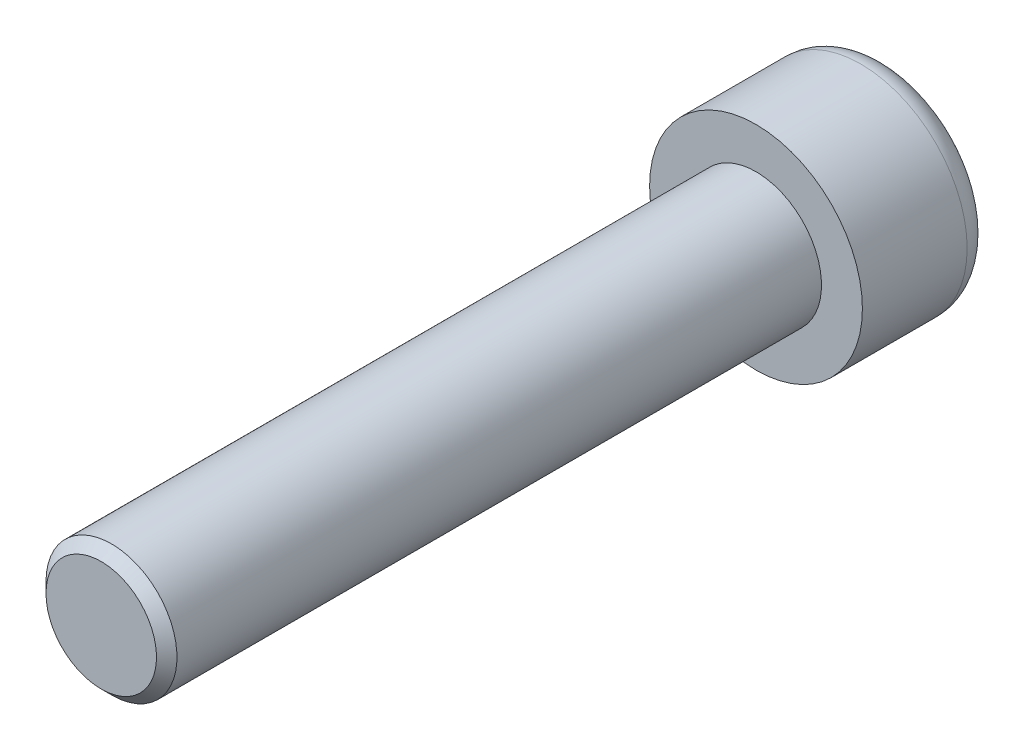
ISO-10303-21;
HEADER;
FILE_DESCRIPTION(('STEP AP214'),'2;1');
FILE_NAME('part.step','',(''),(''),'','','');
FILE_SCHEMA(('AUTOMOTIVE_DESIGN { 1 0 10303 214 1 1 1 1 }'));
ENDSEC;
DATA;
#1=APPLICATION_CONTEXT('core data for automotive mechanical design processes');
#2=APPLICATION_PROTOCOL_DEFINITION('international standard','automotive_design',2000,#1);
#3=PRODUCT_CONTEXT('',#1,'mechanical');
#4=PRODUCT('Part','Part','',(#3));
#5=PRODUCT_RELATED_PRODUCT_CATEGORY('part','',(#4));
#6=PRODUCT_DEFINITION_FORMATION('','',#4);
#7=PRODUCT_DEFINITION_CONTEXT('part definition',#1,'design');
#8=PRODUCT_DEFINITION('design','',#6,#7);
#9=PRODUCT_DEFINITION_SHAPE('','',#8);
#10=(LENGTH_UNIT() NAMED_UNIT(*) SI_UNIT(.MILLI.,.METRE.));
#11=(NAMED_UNIT(*) PLANE_ANGLE_UNIT() SI_UNIT($,.RADIAN.));
#12=(NAMED_UNIT(*) SI_UNIT($,.STERADIAN.) SOLID_ANGLE_UNIT());
#13=UNCERTAINTY_MEASURE_WITH_UNIT(LENGTH_MEASURE(1.E-05),#10,'distance_accuracy_value','');
#14=(GEOMETRIC_REPRESENTATION_CONTEXT(3) GLOBAL_UNCERTAINTY_ASSIGNED_CONTEXT((#13)) GLOBAL_UNIT_ASSIGNED_CONTEXT((#10,
#11,#12)) REPRESENTATION_CONTEXT('',''));
#15=CARTESIAN_POINT('',(0.,0.,0.));
#16=DIRECTION('',(0.,0.,1.));
#17=DIRECTION('',(1.,0.,0.));
#18=AXIS2_PLACEMENT_3D('',#15,#16,#17);
#19=CARTESIAN_POINT('',(-4.71844785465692E-13,5.27355936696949E-13,8.00000000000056));
#20=DIRECTION('',(0.,0.,0.99999999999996));
#21=DIRECTION('',(1.00000000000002,0.,0.));
#22=AXIS2_PLACEMENT_3D('',#19,#20,#21);
#23=PLANE('',#22);
#24=CARTESIAN_POINT('',(-4.71844785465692E-13,5.27355936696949E-13,8.00000000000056));
#25=DIRECTION('',(0.,0.,0.99999999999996));
#26=DIRECTION('',(1.00000000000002,0.,0.));
#27=AXIS2_PLACEMENT_3D('',#24,#25,#26);
#28=CIRCLE('',#27,6.5);
#29=CARTESIAN_POINT('',(-6.50000000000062,5.77149439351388E-13,8.00000000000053));
#30=VERTEX_POINT('',#29);
#31=EDGE_CURVE('E137',#30,#30,#28,.T.);
#32=ORIENTED_EDGE('',*,*,#31,.T.);
#33=EDGE_LOOP('',(#32));
#34=FACE_BOUND('',#33,.T.);
#35=CARTESIAN_POINT('',(-4.71844785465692E-13,5.27355936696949E-13,8.00000000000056));
#36=DIRECTION('',(0.,0.,0.99999999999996));
#37=DIRECTION('',(1.00000000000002,0.,0.));
#38=AXIS2_PLACEMENT_3D('',#35,#36,#37);
#39=CIRCLE('',#38,4.);
#40=CARTESIAN_POINT('',(-4.00000000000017,8.74168360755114E-13,8.00000000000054));
#41=VERTEX_POINT('',#40);
#42=EDGE_CURVE('E124',#41,#41,#39,.T.);
#43=ORIENTED_EDGE('',*,*,#42,.F.);
#44=EDGE_LOOP('',(#43));
#45=FACE_BOUND('',#44,.T.);
#46=ADVANCED_FACE('F34',(#34,#45),#23,.T.);
#47=CARTESIAN_POINT('',(-4.71844785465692E-13,5.27355936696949E-13,8.00000000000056));
#48=DIRECTION('',(0.,0.,-0.99999999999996));
#49=DIRECTION('',(-1.00000000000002,0.,0.));
#50=AXIS2_PLACEMENT_3D('',#47,#48,#49);
#51=CYLINDRICAL_SURFACE('',#50,6.5);
#52=CARTESIAN_POINT('',(3.33066907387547E-13,6.93889390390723E-13,1.59999999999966));
#53=DIRECTION('',(0.,0.,0.99999999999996));
#54=DIRECTION('',(1.00000000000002,0.,0.));
#55=AXIS2_PLACEMENT_3D('',#52,#53,#54);
#56=CIRCLE('',#55,6.5);
#57=CARTESIAN_POINT('',(-6.50000000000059,5.87768653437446E-13,1.59999999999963));
#58=VERTEX_POINT('',#57);
#59=EDGE_CURVE('E42',#58,#58,#56,.T.);
#60=CARTESIAN_POINT('',(-6.50000000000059,5.87768653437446E-13,1.59999999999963));
#61=CARTESIAN_POINT('',(-6.50000000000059,5.87658036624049E-13,1.66666666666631));
#62=CARTESIAN_POINT('',(-6.50000000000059,5.87547419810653E-13,1.73333333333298));
#63=CARTESIAN_POINT('',(-6.50000000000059,5.8732618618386E-13,1.86666666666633));
#64=CARTESIAN_POINT('',(-6.50000000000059,5.87215569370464E-13,1.93333333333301));
#65=CARTESIAN_POINT('',(-6.50000000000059,5.86994335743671E-13,2.06666666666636));
#66=CARTESIAN_POINT('',(-6.50000000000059,5.86883718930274E-13,2.13333333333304));
#67=CARTESIAN_POINT('',(-6.50000000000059,5.86662485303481E-13,2.26666666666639));
#68=CARTESIAN_POINT('',(-6.50000000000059,5.86551868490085E-13,2.33333333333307));
#69=CARTESIAN_POINT('',(-6.50000000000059,5.86330634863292E-13,2.46666666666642));
#70=CARTESIAN_POINT('',(-6.50000000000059,5.86220018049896E-13,2.53333333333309));
#71=CARTESIAN_POINT('',(-6.50000000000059,5.85998784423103E-13,2.66666666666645));
#72=CARTESIAN_POINT('',(-6.50000000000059,5.85888167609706E-13,2.73333333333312));
#73=CARTESIAN_POINT('',(-6.50000000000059,5.85666933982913E-13,2.86666666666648));
#74=CARTESIAN_POINT('',(-6.5000000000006,5.85556317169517E-13,2.93333333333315));
#75=CARTESIAN_POINT('',(-6.5000000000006,5.85335083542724E-13,3.0666666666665));
#76=CARTESIAN_POINT('',(-6.5000000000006,5.85224466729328E-13,3.13333333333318));
#77=CARTESIAN_POINT('',(-6.5000000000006,5.85003233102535E-13,3.26666666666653));
#78=CARTESIAN_POINT('',(-6.5000000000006,5.84892616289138E-13,3.33333333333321));
#79=CARTESIAN_POINT('',(-6.5000000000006,5.84671382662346E-13,3.46666666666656));
#80=CARTESIAN_POINT('',(-6.5000000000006,5.84560765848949E-13,3.53333333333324));
#81=CARTESIAN_POINT('',(-6.5000000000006,5.84339532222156E-13,3.66666666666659));
#82=CARTESIAN_POINT('',(-6.5000000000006,5.8422891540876E-13,3.73333333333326));
#83=CARTESIAN_POINT('',(-6.5000000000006,5.84007681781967E-13,3.86666666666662));
#84=CARTESIAN_POINT('',(-6.5000000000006,5.8389706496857E-13,3.93333333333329));
#85=CARTESIAN_POINT('',(-6.5000000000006,5.83675831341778E-13,4.06666666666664));
#86=CARTESIAN_POINT('',(-6.5000000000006,5.83565214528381E-13,4.13333333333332));
#87=CARTESIAN_POINT('',(-6.5000000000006,5.83343980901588E-13,4.26666666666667));
#88=CARTESIAN_POINT('',(-6.5000000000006,5.83233364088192E-13,4.33333333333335));
#89=CARTESIAN_POINT('',(-6.5000000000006,5.83012130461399E-13,4.4666666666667));
#90=CARTESIAN_POINT('',(-6.5000000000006,5.82901513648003E-13,4.53333333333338));
#91=CARTESIAN_POINT('',(-6.5000000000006,5.8268028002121E-13,4.66666666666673));
#92=CARTESIAN_POINT('',(-6.5000000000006,5.82569663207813E-13,4.73333333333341));
#93=CARTESIAN_POINT('',(-6.5000000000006,5.8234842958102E-13,4.86666666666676));
#94=CARTESIAN_POINT('',(-6.5000000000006,5.82237812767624E-13,4.93333333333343));
#95=CARTESIAN_POINT('',(-6.5000000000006,5.82016579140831E-13,5.06666666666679));
#96=CARTESIAN_POINT('',(-6.5000000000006,5.81905962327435E-13,5.13333333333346));
#97=CARTESIAN_POINT('',(-6.5000000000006,5.81684728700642E-13,5.26666666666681));
#98=CARTESIAN_POINT('',(-6.5000000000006,5.81574111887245E-13,5.33333333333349));
#99=CARTESIAN_POINT('',(-6.5000000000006,5.81352878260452E-13,5.46666666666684));
#100=CARTESIAN_POINT('',(-6.50000000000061,5.81242261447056E-13,5.53333333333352));
#101=CARTESIAN_POINT('',(-6.50000000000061,5.81021027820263E-13,5.66666666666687));
#102=CARTESIAN_POINT('',(-6.50000000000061,5.80910411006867E-13,5.73333333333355));
#103=CARTESIAN_POINT('',(-6.50000000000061,5.80689177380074E-13,5.8666666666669));
#104=CARTESIAN_POINT('',(-6.50000000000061,5.80578560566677E-13,5.93333333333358));
#105=CARTESIAN_POINT('',(-6.50000000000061,5.80357326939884E-13,6.06666666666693));
#106=CARTESIAN_POINT('',(-6.50000000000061,5.80246710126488E-13,6.1333333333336));
#107=CARTESIAN_POINT('',(-6.50000000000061,5.80025476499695E-13,6.26666666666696));
#108=CARTESIAN_POINT('',(-6.50000000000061,5.79914859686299E-13,6.33333333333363));
#109=CARTESIAN_POINT('',(-6.50000000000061,5.79693626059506E-13,6.46666666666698));
#110=CARTESIAN_POINT('',(-6.50000000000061,5.79583009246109E-13,6.53333333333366));
#111=CARTESIAN_POINT('',(-6.50000000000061,5.79361775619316E-13,6.66666666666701));
#112=CARTESIAN_POINT('',(-6.50000000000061,5.7925115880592E-13,6.73333333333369));
#113=CARTESIAN_POINT('',(-6.50000000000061,5.79029925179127E-13,6.86666666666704));
#114=CARTESIAN_POINT('',(-6.50000000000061,5.78919308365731E-13,6.93333333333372));
#115=CARTESIAN_POINT('',(-6.50000000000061,5.78698074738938E-13,7.06666666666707));
#116=CARTESIAN_POINT('',(-6.50000000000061,5.78587457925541E-13,7.13333333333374));
#117=CARTESIAN_POINT('',(-6.50000000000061,5.78366224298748E-13,7.2666666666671));
#118=CARTESIAN_POINT('',(-6.50000000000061,5.78255607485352E-13,7.33333333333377));
#119=CARTESIAN_POINT('',(-6.50000000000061,5.78034373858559E-13,7.46666666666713));
#120=CARTESIAN_POINT('',(-6.50000000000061,5.77923757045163E-13,7.5333333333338));
#121=CARTESIAN_POINT('',(-6.50000000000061,5.7770252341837E-13,7.66666666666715));
#122=CARTESIAN_POINT('',(-6.50000000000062,5.77591906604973E-13,7.73333333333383));
#123=CARTESIAN_POINT('',(-6.50000000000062,5.77370672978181E-13,7.86666666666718));
#124=CARTESIAN_POINT('',(-6.50000000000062,5.77260056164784E-13,7.93333333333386));
#125=CARTESIAN_POINT('',(-6.50000000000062,5.77149439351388E-13,8.00000000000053));
#126=B_SPLINE_CURVE_WITH_KNOTS('',3,(#60,#61,#62,#63,#64,#65,#66,#67,#68,#69,#70,#71,#72,#73,
#74,#75,#76,#77,#78,#79,#80,#81,#82,#83,#84,#85,#86,#87,#88,#89,#90,#91,#92,#93,#94,#95,#96,#97,
#98,#99,#100,#101,#102,#103,#104,#105,#106,#107,#108,#109,#110,#111,#112,#113,#114,#115,#116,
#117,#118,#119,#120,#121,#122,#123,#124,#125),.UNSPECIFIED.,.F.,.F.,(4,2,2,2,2,2,2,2,2,2,2,2,2,
2,2,2,2,2,2,2,2,2,2,2,2,2,2,2,2,2,2,2,4),(0.,0.200000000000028,0.400000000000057,
0.600000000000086,0.800000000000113,1.00000000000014,1.20000000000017,1.4000000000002,
1.60000000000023,1.80000000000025,2.00000000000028,2.20000000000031,2.40000000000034,
2.60000000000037,2.8000000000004,3.00000000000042,3.20000000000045,3.40000000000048,
3.60000000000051,3.80000000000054,4.00000000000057,4.20000000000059,4.40000000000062,
4.60000000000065,4.80000000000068,5.00000000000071,5.20000000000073,5.40000000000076,
5.60000000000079,5.80000000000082,6.00000000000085,6.20000000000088,6.4000000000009),.UNSPECIFIED.);
#127=EDGE_CURVE('BSEAM147',#58,#30,#126,.T.);
#128=ORIENTED_EDGE('',*,*,#59,.T.);
#129=ORIENTED_EDGE('',*,*,#31,.F.);
#130=ORIENTED_EDGE('',*,*,#127,.T.);
#131=ORIENTED_EDGE('',*,*,#127,.F.);
#132=EDGE_LOOP('',(#128,#130,#129,#131));
#133=FACE_BOUND('',#132,.T.);
#134=ADVANCED_FACE('F147',(#133),#51,.T.);
#135=CARTESIAN_POINT('',(2.4980018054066E-13,5.55111512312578E-13,-1.11022302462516E-13));
#136=DIRECTION('',(0.,0.,0.99999999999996));
#137=DIRECTION('',(1.00000000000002,0.,0.));
#138=AXIS2_PLACEMENT_3D('',#135,#136,#137);
#139=PLANE('',#138);
#140=CARTESIAN_POINT('',(2.4980018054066E-13,5.55111512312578E-13,-1.11022302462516E-13));
#141=DIRECTION('',(0.,0.,0.99999999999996));
#142=DIRECTION('',(1.00000000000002,0.,0.));
#143=AXIS2_PLACEMENT_3D('',#140,#141,#142);
#144=CIRCLE('',#143,4.9);
#145=CARTESIAN_POINT('',(4.90000000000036,5.17574871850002E-13,0.));
#146=VERTEX_POINT('',#145);
#147=EDGE_CURVE('E11',#146,#146,#144,.F.);
#148=ORIENTED_EDGE('',*,*,#147,.T.);
#149=EDGE_LOOP('',(#148));
#150=FACE_BOUND('',#149,.T.);
#151=DIRECTION('',(0.866025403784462,-0.499999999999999,0.));
#152=VECTOR('',#151,1.);
#153=CARTESIAN_POINT('',(-5.55111512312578E-13,3.46410161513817,2.77555756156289E-13));
#154=LINE('',#153,#152);
#155=CARTESIAN_POINT('',(-5.55111512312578E-13,3.46410161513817,2.77555756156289E-13));
#156=VERTEX_POINT('',#155);
#157=CARTESIAN_POINT('',(2.99999999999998,1.73205080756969,1.11022302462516E-12));
#158=VERTEX_POINT('',#157);
#159=EDGE_CURVE('E123',#156,#158,#154,.T.);
#160=ORIENTED_EDGE('',*,*,#159,.F.);
#161=DIRECTION('',(0.866025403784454,0.499999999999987,0.));
#162=VECTOR('',#161,1.);
#163=CARTESIAN_POINT('',(-5.55111512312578E-13,3.46410161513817,2.77555756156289E-13));
#164=LINE('',#163,#162);
#165=CARTESIAN_POINT('',(-3.00000000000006,1.73205080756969,0.));
#166=VERTEX_POINT('',#165);
#167=EDGE_CURVE('E49',#166,#156,#164,.T.);
#168=ORIENTED_EDGE('',*,*,#167,.F.);
#169=DIRECTION('',(0.,0.999999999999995,0.));
#170=VECTOR('',#169,1.);
#171=CARTESIAN_POINT('',(-3.00000000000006,1.73205080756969,0.));
#172=LINE('',#171,#170);
#173=CARTESIAN_POINT('',(-2.99999999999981,-1.73205080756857,-7.7715611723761E-13));
#174=VERTEX_POINT('',#173);
#175=EDGE_CURVE('E133',#174,#166,#172,.T.);
#176=ORIENTED_EDGE('',*,*,#175,.F.);
#177=DIRECTION('',(-0.866025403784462,0.499999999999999,0.));
#178=VECTOR('',#177,1.);
#179=CARTESIAN_POINT('',(-2.99999999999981,-1.73205080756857,-7.7715611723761E-13));
#180=LINE('',#179,#178);
#181=CARTESIAN_POINT('',(0.,-3.46410161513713,2.77555756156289E-13));
#182=VERTEX_POINT('',#181);
#183=EDGE_CURVE('E131',#182,#174,#180,.T.);
#184=ORIENTED_EDGE('',*,*,#183,.F.);
#185=DIRECTION('',(-0.866025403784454,-0.499999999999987,0.));
#186=VECTOR('',#185,1.);
#187=CARTESIAN_POINT('',(3.00000000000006,-1.73205080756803,5.55111512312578E-13));
#188=LINE('',#187,#186);
#189=CARTESIAN_POINT('',(3.00000000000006,-1.73205080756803,5.55111512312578E-13));
#190=VERTEX_POINT('',#189);
#191=EDGE_CURVE('E97',#190,#182,#188,.T.);
#192=ORIENTED_EDGE('',*,*,#191,.F.);
#193=DIRECTION('',(0.,-0.999999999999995,0.));
#194=VECTOR('',#193,1.);
#195=CARTESIAN_POINT('',(2.99999999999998,1.73205080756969,1.11022302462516E-12));
#196=LINE('',#195,#194);
#197=EDGE_CURVE('E127',#158,#190,#196,.T.);
#198=ORIENTED_EDGE('',*,*,#197,.F.);
#199=EDGE_LOOP('',(#160,#168,#176,#184,#192,#198));
#200=FACE_BOUND('',#199,.T.);
#201=ADVANCED_FACE('F169',(#150,#200),#139,.F.);
#202=CARTESIAN_POINT('',(-3.05311331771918E-13,3.46410161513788,4.99999999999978));
#203=DIRECTION('',(-0.500000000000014,0.866025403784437,0.));
#204=DIRECTION('',(-0.866025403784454,-0.499999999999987,0.));
#205=AXIS2_PLACEMENT_3D('',#202,#203,#204);
#206=PLANE('',#205);
#207=ORIENTED_EDGE('',*,*,#167,.T.);
#208=DIRECTION('',(0.,0.,-0.99999999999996));
#209=VECTOR('',#208,1.);
#210=CARTESIAN_POINT('',(-3.05311331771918E-13,3.46410161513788,4.99999999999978));
#211=LINE('',#210,#209);
#212=CARTESIAN_POINT('',(-3.05311331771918E-13,3.46410161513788,4.99999999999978));
#213=VERTEX_POINT('',#212);
#214=EDGE_CURVE('E79',#213,#156,#211,.T.);
#215=ORIENTED_EDGE('',*,*,#214,.F.);
#216=DIRECTION('',(0.866025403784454,0.499999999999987,0.));
#217=VECTOR('',#216,1.);
#218=CARTESIAN_POINT('',(-3.05311331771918E-13,3.46410161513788,4.99999999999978));
#219=LINE('',#218,#217);
#220=CARTESIAN_POINT('',(-3.00000000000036,1.73205080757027,4.99999999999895));
#221=VERTEX_POINT('',#220);
#222=EDGE_CURVE('E135',#221,#213,#219,.T.);
#223=ORIENTED_EDGE('',*,*,#222,.F.);
#224=DIRECTION('',(0.,0.,-0.99999999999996));
#225=VECTOR('',#224,1.);
#226=CARTESIAN_POINT('',(-3.00000000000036,1.73205080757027,4.99999999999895));
#227=LINE('',#226,#225);
#228=EDGE_CURVE('E57',#221,#166,#227,.T.);
#229=ORIENTED_EDGE('',*,*,#228,.T.);
#230=EDGE_LOOP('',(#207,#215,#223,#229));
#231=FACE_BOUND('',#230,.T.);
#232=ADVANCED_FACE('F173',(#231),#206,.F.);
#233=CARTESIAN_POINT('',(-3.00000000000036,1.73205080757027,4.99999999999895));
#234=DIRECTION('',(-1.00000000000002,0.,0.));
#235=DIRECTION('',(0.,0.,0.99999999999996));
#236=AXIS2_PLACEMENT_3D('',#233,#234,#235);
#237=PLANE('',#236);
#238=ORIENTED_EDGE('',*,*,#175,.T.);
#239=ORIENTED_EDGE('',*,*,#228,.F.);
#240=DIRECTION('',(0.,0.999999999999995,0.));
#241=VECTOR('',#240,1.);
#242=CARTESIAN_POINT('',(-3.00000000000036,1.73205080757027,4.99999999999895));
#243=LINE('',#242,#241);
#244=CARTESIAN_POINT('',(-3.00000000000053,-1.73205080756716,5.00000000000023));
#245=VERTEX_POINT('',#244);
#246=EDGE_CURVE('E109',#245,#221,#243,.T.);
#247=ORIENTED_EDGE('',*,*,#246,.F.);
#248=DIRECTION('',(0.,0.,-0.99999999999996));
#249=VECTOR('',#248,1.);
#250=CARTESIAN_POINT('',(-3.00000000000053,-1.73205080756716,5.00000000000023));
#251=LINE('',#250,#249);
#252=EDGE_CURVE('E101',#245,#174,#251,.T.);
#253=ORIENTED_EDGE('',*,*,#252,.T.);
#254=EDGE_LOOP('',(#238,#239,#247,#253));
#255=FACE_BOUND('',#254,.T.);
#256=ADVANCED_FACE('F180',(#255),#237,.F.);
#257=CARTESIAN_POINT('',(-3.00000000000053,-1.73205080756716,5.00000000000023));
#258=DIRECTION('',(-0.500000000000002,-0.866025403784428,0.));
#259=DIRECTION('',(0.866025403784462,-0.499999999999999,0.));
#260=AXIS2_PLACEMENT_3D('',#257,#258,#259);
#261=PLANE('',#260);
#262=ORIENTED_EDGE('',*,*,#183,.T.);
#263=ORIENTED_EDGE('',*,*,#252,.F.);
#264=DIRECTION('',(-0.866025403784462,0.499999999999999,0.));
#265=VECTOR('',#264,1.);
#266=CARTESIAN_POINT('',(-3.00000000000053,-1.73205080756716,5.00000000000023));
#267=LINE('',#266,#265);
#268=CARTESIAN_POINT('',(0.,-3.46410161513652,4.9999999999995));
#269=VERTEX_POINT('',#268);
#270=EDGE_CURVE('E105',#269,#245,#267,.T.);
#271=ORIENTED_EDGE('',*,*,#270,.F.);
#272=DIRECTION('',(0.,0.,-0.99999999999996));
#273=VECTOR('',#272,1.);
#274=CARTESIAN_POINT('',(0.,-3.46410161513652,4.9999999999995));
#275=LINE('',#274,#273);
#276=EDGE_CURVE('E90',#269,#182,#275,.T.);
#277=ORIENTED_EDGE('',*,*,#276,.T.);
#278=EDGE_LOOP('',(#262,#263,#271,#277));
#279=FACE_BOUND('',#278,.T.);
#280=ADVANCED_FACE('F106',(#279),#261,.F.);
#281=CARTESIAN_POINT('',(3.00000000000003,-1.73205080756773,5.00000000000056));
#282=DIRECTION('',(0.500000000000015,-0.866025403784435,0.));
#283=DIRECTION('',(0.866025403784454,0.499999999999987,0.));
#284=AXIS2_PLACEMENT_3D('',#281,#282,#283);
#285=PLANE('',#284);
#286=ORIENTED_EDGE('',*,*,#191,.T.);
#287=ORIENTED_EDGE('',*,*,#276,.F.);
#288=DIRECTION('',(-0.866025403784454,-0.499999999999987,0.));
#289=VECTOR('',#288,1.);
#290=CARTESIAN_POINT('',(3.00000000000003,-1.73205080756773,5.00000000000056));
#291=LINE('',#290,#289);
#292=CARTESIAN_POINT('',(3.00000000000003,-1.73205080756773,5.00000000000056));
#293=VERTEX_POINT('',#292);
#294=EDGE_CURVE('E94',#293,#269,#291,.T.);
#295=ORIENTED_EDGE('',*,*,#294,.F.);
#296=DIRECTION('',(0.,0.,-0.99999999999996));
#297=VECTOR('',#296,1.);
#298=CARTESIAN_POINT('',(3.00000000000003,-1.73205080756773,5.00000000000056));
#299=LINE('',#298,#297);
#300=EDGE_CURVE('E102',#293,#190,#299,.T.);
#301=ORIENTED_EDGE('',*,*,#300,.T.);
#302=EDGE_LOOP('',(#286,#287,#295,#301));
#303=FACE_BOUND('',#302,.T.);
#304=ADVANCED_FACE('F92',(#303),#285,.F.);
#305=CARTESIAN_POINT('',(2.99999999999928,1.7320508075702,4.99999999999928));
#306=DIRECTION('',(1.00000000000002,0.,0.));
#307=DIRECTION('',(0.,0.,-0.99999999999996));
#308=AXIS2_PLACEMENT_3D('',#305,#306,#307);
#309=PLANE('',#308);
#310=ORIENTED_EDGE('',*,*,#197,.T.);
#311=ORIENTED_EDGE('',*,*,#300,.F.);
#312=DIRECTION('',(0.,-0.999999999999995,0.));
#313=VECTOR('',#312,1.);
#314=CARTESIAN_POINT('',(2.99999999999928,1.7320508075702,4.99999999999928));
#315=LINE('',#314,#313);
#316=CARTESIAN_POINT('',(2.99999999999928,1.7320508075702,4.99999999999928));
#317=VERTEX_POINT('',#316);
#318=EDGE_CURVE('E115',#317,#293,#315,.T.);
#319=ORIENTED_EDGE('',*,*,#318,.F.);
#320=DIRECTION('',(0.,0.,-0.99999999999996));
#321=VECTOR('',#320,1.);
#322=CARTESIAN_POINT('',(2.99999999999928,1.7320508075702,4.99999999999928));
#323=LINE('',#322,#321);
#324=EDGE_CURVE('E140',#317,#158,#323,.T.);
#325=ORIENTED_EDGE('',*,*,#324,.T.);
#326=EDGE_LOOP('',(#310,#311,#319,#325));
#327=FACE_BOUND('',#326,.T.);
#328=ADVANCED_FACE('F215',(#327),#309,.F.);
#329=CARTESIAN_POINT('',(-3.05311331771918E-13,3.46410161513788,4.99999999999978));
#330=DIRECTION('',(0.500000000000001,0.866025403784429,0.));
#331=DIRECTION('',(-0.866025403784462,0.499999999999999,0.));
#332=AXIS2_PLACEMENT_3D('',#329,#330,#331);
#333=PLANE('',#332);
#334=ORIENTED_EDGE('',*,*,#159,.T.);
#335=ORIENTED_EDGE('',*,*,#324,.F.);
#336=DIRECTION('',(0.866025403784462,-0.499999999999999,0.));
#337=VECTOR('',#336,1.);
#338=CARTESIAN_POINT('',(-3.05311331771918E-13,3.46410161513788,4.99999999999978));
#339=LINE('',#338,#337);
#340=EDGE_CURVE('E117',#213,#317,#339,.T.);
#341=ORIENTED_EDGE('',*,*,#340,.F.);
#342=ORIENTED_EDGE('',*,*,#214,.T.);
#343=EDGE_LOOP('',(#334,#335,#341,#342));
#344=FACE_BOUND('',#343,.T.);
#345=ADVANCED_FACE('F160',(#344),#333,.F.);
#346=CARTESIAN_POINT('',(-3.00000000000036,1.73205080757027,4.99999999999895));
#347=DIRECTION('',(0.,0.,0.99999999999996));
#348=DIRECTION('',(1.00000000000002,0.,0.));
#349=AXIS2_PLACEMENT_3D('',#346,#347,#348);
#350=PLANE('',#349);
#351=ORIENTED_EDGE('',*,*,#222,.T.);
#352=ORIENTED_EDGE('',*,*,#340,.T.);
#353=ORIENTED_EDGE('',*,*,#318,.T.);
#354=ORIENTED_EDGE('',*,*,#294,.T.);
#355=ORIENTED_EDGE('',*,*,#270,.T.);
#356=ORIENTED_EDGE('',*,*,#246,.T.);
#357=EDGE_LOOP('',(#351,#352,#353,#354,#355,#356));
#358=FACE_BOUND('',#357,.T.);
#359=ADVANCED_FACE('F112',(#358),#350,.F.);
#360=CARTESIAN_POINT('',(3.33066907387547E-13,6.93889390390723E-13,1.59999999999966));
#361=DIRECTION('',(0.,0.,0.99999999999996));
#362=DIRECTION('',(1.00000000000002,0.,0.));
#363=AXIS2_PLACEMENT_3D('',#360,#361,#362);
#364=TOROIDAL_SURFACE('',#363,4.9,1.6);
#365=ORIENTED_EDGE('',*,*,#147,.F.);
#366=EDGE_LOOP('',(#365));
#367=FACE_BOUND('',#366,.T.);
#368=ORIENTED_EDGE('',*,*,#59,.F.);
#369=EDGE_LOOP('',(#368));
#370=FACE_BOUND('',#369,.T.);
#371=ADVANCED_FACE('F36',(#367,#370),#364,.T.);
#372=CARTESIAN_POINT('',(-2.4980018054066E-13,7.7715611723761E-13,47.999999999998));
#373=DIRECTION('',(0.,0.,-0.99999999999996));
#374=DIRECTION('',(-1.00000000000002,0.,0.));
#375=AXIS2_PLACEMENT_3D('',#372,#373,#374);
#376=CYLINDRICAL_SURFACE('',#375,4.);
#377=CARTESIAN_POINT('',(-4.71844785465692E-13,6.38378239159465E-13,47.3749999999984));
#378=DIRECTION('',(0.,0.,-0.99999999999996));
#379=DIRECTION('',(-1.00000000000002,0.,0.));
#380=AXIS2_PLACEMENT_3D('',#377,#378,#379);
#381=CIRCLE('',#380,4.);
#382=CARTESIAN_POINT('',(-4.00000000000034,8.08835305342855E-13,47.3749999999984));
#383=VERTEX_POINT('',#382);
#384=EDGE_CURVE('E193',#383,#383,#381,.T.);
#385=CARTESIAN_POINT('',(-4.00000000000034,8.08835305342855E-13,47.3749999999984));
#386=CARTESIAN_POINT('',(-4.00000000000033,8.09515858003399E-13,46.9648437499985));
#387=CARTESIAN_POINT('',(-4.00000000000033,8.10196410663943E-13,46.5546874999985));
#388=CARTESIAN_POINT('',(-4.00000000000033,8.11557515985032E-13,45.7343749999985));
#389=CARTESIAN_POINT('',(-4.00000000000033,8.12238068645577E-13,45.3242187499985));
#390=CARTESIAN_POINT('',(-4.00000000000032,8.13599173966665E-13,44.5039062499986));
#391=CARTESIAN_POINT('',(-4.00000000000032,8.1427972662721E-13,44.0937499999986));
#392=CARTESIAN_POINT('',(-4.00000000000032,8.15640831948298E-13,43.2734374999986));
#393=CARTESIAN_POINT('',(-4.00000000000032,8.16321384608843E-13,42.8632812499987));
#394=CARTESIAN_POINT('',(-4.00000000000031,8.17682489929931E-13,42.0429687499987));
#395=CARTESIAN_POINT('',(-4.00000000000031,8.18363042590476E-13,41.6328124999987));
#396=CARTESIAN_POINT('',(-4.00000000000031,8.19724147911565E-13,40.8124999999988));
#397=CARTESIAN_POINT('',(-4.00000000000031,8.20404700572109E-13,40.4023437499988));
#398=CARTESIAN_POINT('',(-4.0000000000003,8.21765805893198E-13,39.5820312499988));
#399=CARTESIAN_POINT('',(-4.0000000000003,8.22446358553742E-13,39.1718749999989));
#400=CARTESIAN_POINT('',(-4.0000000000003,8.23807463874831E-13,38.3515624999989));
#401=CARTESIAN_POINT('',(-4.00000000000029,8.24488016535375E-13,37.9414062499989));
#402=CARTESIAN_POINT('',(-4.00000000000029,8.25849121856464E-13,37.121093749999));
#403=CARTESIAN_POINT('',(-4.00000000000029,8.26529674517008E-13,36.710937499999));
#404=CARTESIAN_POINT('',(-4.00000000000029,8.27890779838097E-13,35.890624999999));
#405=CARTESIAN_POINT('',(-4.00000000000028,8.28571332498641E-13,35.4804687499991));
#406=CARTESIAN_POINT('',(-4.00000000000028,8.2993243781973E-13,34.6601562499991));
#407=CARTESIAN_POINT('',(-4.00000000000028,8.30612990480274E-13,34.2499999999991));
#408=CARTESIAN_POINT('',(-4.00000000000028,8.31974095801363E-13,33.4296874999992));
#409=CARTESIAN_POINT('',(-4.00000000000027,8.32654648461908E-13,33.0195312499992));
#410=CARTESIAN_POINT('',(-4.00000000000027,8.34015753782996E-13,32.1992187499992));
#411=CARTESIAN_POINT('',(-4.00000000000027,8.34696306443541E-13,31.7890624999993));
#412=CARTESIAN_POINT('',(-4.00000000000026,8.36057411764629E-13,30.9687499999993));
#413=CARTESIAN_POINT('',(-4.00000000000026,8.36737964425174E-13,30.5585937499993));
#414=CARTESIAN_POINT('',(-4.00000000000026,8.38099069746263E-13,29.7382812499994));
#415=CARTESIAN_POINT('',(-4.00000000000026,8.38779622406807E-13,29.3281249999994));
#416=CARTESIAN_POINT('',(-4.00000000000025,8.40140727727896E-13,28.5078124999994));
#417=CARTESIAN_POINT('',(-4.00000000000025,8.4082128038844E-13,28.0976562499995));
#418=CARTESIAN_POINT('',(-4.00000000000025,8.42182385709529E-13,27.2773437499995));
#419=CARTESIAN_POINT('',(-4.00000000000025,8.42862938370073E-13,26.8671874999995));
#420=CARTESIAN_POINT('',(-4.00000000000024,8.44224043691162E-13,26.0468749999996));
#421=CARTESIAN_POINT('',(-4.00000000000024,8.44904596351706E-13,25.6367187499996));
#422=CARTESIAN_POINT('',(-4.00000000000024,8.46265701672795E-13,24.8164062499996));
#423=CARTESIAN_POINT('',(-4.00000000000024,8.46946254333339E-13,24.4062499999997));
#424=CARTESIAN_POINT('',(-4.00000000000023,8.48307359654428E-13,23.5859374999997));
#425=CARTESIAN_POINT('',(-4.00000000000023,8.48987912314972E-13,23.1757812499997));
#426=CARTESIAN_POINT('',(-4.00000000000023,8.50349017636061E-13,22.3554687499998));
#427=CARTESIAN_POINT('',(-4.00000000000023,8.51029570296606E-13,21.9453124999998));
#428=CARTESIAN_POINT('',(-4.00000000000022,8.52390675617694E-13,21.1249999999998));
#429=CARTESIAN_POINT('',(-4.00000000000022,8.53071228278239E-13,20.7148437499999));
#430=CARTESIAN_POINT('',(-4.00000000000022,8.54432333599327E-13,19.8945312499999));
#431=CARTESIAN_POINT('',(-4.00000000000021,8.55112886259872E-13,19.4843749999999));
#432=CARTESIAN_POINT('',(-4.00000000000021,8.5647399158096E-13,18.6640625));
#433=CARTESIAN_POINT('',(-4.00000000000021,8.57154544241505E-13,18.25390625));
#434=CARTESIAN_POINT('',(-4.00000000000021,8.58515649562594E-13,17.43359375));
#435=CARTESIAN_POINT('',(-4.0000000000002,8.59196202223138E-13,17.0234375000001));
#436=CARTESIAN_POINT('',(-4.0000000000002,8.60557307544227E-13,16.2031250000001));
#437=CARTESIAN_POINT('',(-4.0000000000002,8.61237860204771E-13,15.7929687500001));
#438=CARTESIAN_POINT('',(-4.0000000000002,8.6259896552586E-13,14.9726562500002));
#439=CARTESIAN_POINT('',(-4.00000000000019,8.63279518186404E-13,14.5625000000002));
#440=CARTESIAN_POINT('',(-4.00000000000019,8.64640623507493E-13,13.7421875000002));
#441=CARTESIAN_POINT('',(-4.00000000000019,8.65321176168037E-13,13.3320312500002));
#442=CARTESIAN_POINT('',(-4.00000000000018,8.66682281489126E-13,12.5117187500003));
#443=CARTESIAN_POINT('',(-4.00000000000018,8.6736283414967E-13,12.1015625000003));
#444=CARTESIAN_POINT('',(-4.00000000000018,8.68723939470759E-13,11.2812500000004));
#445=CARTESIAN_POINT('',(-4.00000000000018,8.69404492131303E-13,10.8710937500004));
#446=CARTESIAN_POINT('',(-4.00000000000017,8.70765597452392E-13,10.0507812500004));
#447=CARTESIAN_POINT('',(-4.00000000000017,8.71446150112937E-13,9.64062500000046));
#448=CARTESIAN_POINT('',(-4.00000000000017,8.72807255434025E-13,8.8203125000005));
#449=CARTESIAN_POINT('',(-4.00000000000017,8.7348780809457E-13,8.41015625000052));
#450=CARTESIAN_POINT('',(-4.00000000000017,8.74168360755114E-13,8.00000000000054));
#451=B_SPLINE_CURVE_WITH_KNOTS('',3,(#385,#386,#387,#388,#389,#390,#391,#392,#393,#394,#395,
#396,#397,#398,#399,#400,#401,#402,#403,#404,#405,#406,#407,#408,#409,#410,#411,#412,#413,#414,
#415,#416,#417,#418,#419,#420,#421,#422,#423,#424,#425,#426,#427,#428,#429,#430,#431,#432,#433,
#434,#435,#436,#437,#438,#439,#440,#441,#442,#443,#444,#445,#446,#447,#448,#449,#450),
.UNSPECIFIED.,.F.,.F.,(4,2,2,2,2,2,2,2,2,2,2,2,2,2,2,2,2,2,2,2,2,2,2,2,2,2,2,2,2,2,2,2,4),(0.,
1.23046874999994,2.46093749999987,3.69140624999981,4.92187499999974,6.15234374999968,
7.38281249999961,8.61328124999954,9.84374999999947,11.0742187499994,12.3046874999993,
13.5351562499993,14.7656249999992,15.9960937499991,17.2265624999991,18.457031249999,
19.6874999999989,20.9179687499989,22.1484374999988,23.3789062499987,24.6093749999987,
25.8398437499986,27.0703124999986,28.3007812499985,29.5312499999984,30.7617187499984,
31.9921874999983,33.2226562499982,34.4531249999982,35.6835937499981,36.914062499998,
38.144531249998,39.3749999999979),.UNSPECIFIED.);
#452=EDGE_CURVE('BSEAM151',#383,#41,#451,.T.);
#453=ORIENTED_EDGE('',*,*,#384,.T.);
#454=ORIENTED_EDGE('',*,*,#42,.T.);
#455=ORIENTED_EDGE('',*,*,#452,.T.);
#456=ORIENTED_EDGE('',*,*,#452,.F.);
#457=EDGE_LOOP('',(#453,#455,#454,#456));
#458=FACE_BOUND('',#457,.T.);
#459=ADVANCED_FACE('F151',(#458),#376,.T.);
#460=CARTESIAN_POINT('',(-2.4980018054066E-13,7.7715611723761E-13,47.999999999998));
#461=DIRECTION('',(0.,0.,-0.99999999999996));
#462=DIRECTION('',(-1.00000000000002,0.,0.));
#463=AXIS2_PLACEMENT_3D('',#460,#461,#462);
#464=CONICAL_SURFACE('',#463,3.375,0.785398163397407);
#465=CARTESIAN_POINT('',(-2.4980018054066E-13,7.7715611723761E-13,47.999999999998));
#466=DIRECTION('',(0.,0.,-0.99999999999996));
#467=DIRECTION('',(-1.00000000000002,0.,0.));
#468=AXIS2_PLACEMENT_3D('',#465,#466,#467);
#469=CIRCLE('',#468,3.375);
#470=CARTESIAN_POINT('',(-3.37500000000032,8.03010435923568E-13,47.999999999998));
#471=VERTEX_POINT('',#470);
#472=EDGE_CURVE('E190',#471,#471,#469,.T.);
#473=CARTESIAN_POINT('',(-3.9999999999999,8.08835305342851E-13,47.3749999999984));
#474=CARTESIAN_POINT('',(-3.99348958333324,8.08774629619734E-13,47.3815104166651));
#475=CARTESIAN_POINT('',(-3.98697916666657,8.08713953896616E-13,47.3880208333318));
#476=CARTESIAN_POINT('',(-3.97395833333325,8.08592602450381E-13,47.4010416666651));
#477=CARTESIAN_POINT('',(-3.96744791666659,8.08531926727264E-13,47.4075520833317));
#478=CARTESIAN_POINT('',(-3.95442708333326,8.08410575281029E-13,47.4205729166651));
#479=CARTESIAN_POINT('',(-3.9479166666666,8.08349899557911E-13,47.4270833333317));
#480=CARTESIAN_POINT('',(-3.93489583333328,8.08228548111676E-13,47.4401041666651));
#481=CARTESIAN_POINT('',(-3.92838541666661,8.08167872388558E-13,47.4466145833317));
#482=CARTESIAN_POINT('',(-3.91536458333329,8.08046520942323E-13,47.459635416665));
#483=CARTESIAN_POINT('',(-3.90885416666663,8.07985845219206E-13,47.4661458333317));
#484=CARTESIAN_POINT('',(-3.8958333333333,8.07864493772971E-13,47.479166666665));
#485=CARTESIAN_POINT('',(-3.88932291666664,8.07803818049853E-13,47.4856770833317));
#486=CARTESIAN_POINT('',(-3.87630208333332,8.07682466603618E-13,47.498697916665));
#487=CARTESIAN_POINT('',(-3.86979166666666,8.07621790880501E-13,47.5052083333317));
#488=CARTESIAN_POINT('',(-3.85677083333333,8.07500439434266E-13,47.518229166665));
#489=CARTESIAN_POINT('',(-3.85026041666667,8.07439763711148E-13,47.5247395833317));
#490=CARTESIAN_POINT('',(-3.83723958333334,8.07318412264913E-13,47.537760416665));
#491=CARTESIAN_POINT('',(-3.83072916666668,8.07257736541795E-13,47.5442708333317));
#492=CARTESIAN_POINT('',(-3.81770833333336,8.0713638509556E-13,47.557291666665));
#493=CARTESIAN_POINT('',(-3.8111979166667,8.07075709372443E-13,47.5638020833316));
#494=CARTESIAN_POINT('',(-3.79817708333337,8.06954357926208E-13,47.576822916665));
#495=CARTESIAN_POINT('',(-3.79166666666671,8.0689368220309E-13,47.5833333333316));
#496=CARTESIAN_POINT('',(-3.77864583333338,8.06772330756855E-13,47.5963541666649));
#497=CARTESIAN_POINT('',(-3.77213541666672,8.06711655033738E-13,47.6028645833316));
#498=CARTESIAN_POINT('',(-3.7591145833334,8.06590303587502E-13,47.6158854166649));
#499=CARTESIAN_POINT('',(-3.75260416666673,8.06529627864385E-13,47.6223958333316));
#500=CARTESIAN_POINT('',(-3.73958333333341,8.0640827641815E-13,47.6354166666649));
#501=CARTESIAN_POINT('',(-3.73307291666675,8.06347600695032E-13,47.6419270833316));
#502=CARTESIAN_POINT('',(-3.72005208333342,8.06226249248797E-13,47.6549479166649));
#503=CARTESIAN_POINT('',(-3.71354166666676,8.0616557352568E-13,47.6614583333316));
#504=CARTESIAN_POINT('',(-3.70052083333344,8.06044222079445E-13,47.6744791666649));
#505=CARTESIAN_POINT('',(-3.69401041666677,8.05983546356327E-13,47.6809895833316));
#506=CARTESIAN_POINT('',(-3.68098958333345,8.05862194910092E-13,47.6940104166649));
#507=CARTESIAN_POINT('',(-3.67447916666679,8.05801519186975E-13,47.7005208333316));
#508=CARTESIAN_POINT('',(-3.66145833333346,8.05680167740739E-13,47.7135416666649));
#509=CARTESIAN_POINT('',(-3.6549479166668,8.05619492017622E-13,47.7200520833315));
#510=CARTESIAN_POINT('',(-3.64192708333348,8.05498140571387E-13,47.7330729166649));
#511=CARTESIAN_POINT('',(-3.63541666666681,8.05437464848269E-13,47.7395833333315));
#512=CARTESIAN_POINT('',(-3.62239583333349,8.05316113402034E-13,47.7526041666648));
#513=CARTESIAN_POINT('',(-3.61588541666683,8.05255437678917E-13,47.7591145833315));
#514=CARTESIAN_POINT('',(-3.6028645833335,8.05134086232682E-13,47.7721354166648));
#515=CARTESIAN_POINT('',(-3.59635416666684,8.05073410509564E-13,47.7786458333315));
#516=CARTESIAN_POINT('',(-3.58333333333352,8.04952059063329E-13,47.7916666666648));
#517=CARTESIAN_POINT('',(-3.57682291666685,8.04891383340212E-13,47.7981770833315));
#518=CARTESIAN_POINT('',(-3.56380208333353,8.04770031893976E-13,47.8111979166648));
#519=CARTESIAN_POINT('',(-3.55729166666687,8.04709356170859E-13,47.8177083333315));
#520=CARTESIAN_POINT('',(-3.54427083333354,8.04588004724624E-13,47.8307291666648));
#521=CARTESIAN_POINT('',(-3.53776041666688,8.04527329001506E-13,47.8372395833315));
#522=CARTESIAN_POINT('',(-3.52473958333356,8.04405977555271E-13,47.8502604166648));
#523=CARTESIAN_POINT('',(-3.51822916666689,8.04345301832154E-13,47.8567708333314));
#524=CARTESIAN_POINT('',(-3.50520833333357,8.04223950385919E-13,47.8697916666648));
#525=CARTESIAN_POINT('',(-3.49869791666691,8.04163274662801E-13,47.8763020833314));
#526=CARTESIAN_POINT('',(-3.48567708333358,8.04041923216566E-13,47.8893229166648));
#527=CARTESIAN_POINT('',(-3.47916666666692,8.03981247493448E-13,47.8958333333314));
#528=CARTESIAN_POINT('',(-3.4661458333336,8.03859896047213E-13,47.9088541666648));
#529=CARTESIAN_POINT('',(-3.45963541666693,8.03799220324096E-13,47.9153645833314));
#530=CARTESIAN_POINT('',(-3.44661458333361,8.03677868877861E-13,47.9283854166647));
#531=CARTESIAN_POINT('',(-3.44010416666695,8.03617193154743E-13,47.9348958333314));
#532=CARTESIAN_POINT('',(-3.42708333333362,8.03495841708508E-13,47.9479166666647));
#533=CARTESIAN_POINT('',(-3.42057291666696,8.03435165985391E-13,47.9544270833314));
#534=CARTESIAN_POINT('',(-3.40755208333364,8.03313814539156E-13,47.9674479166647));
#535=CARTESIAN_POINT('',(-3.40104166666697,8.03253138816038E-13,47.9739583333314));
#536=CARTESIAN_POINT('',(-3.38802083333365,8.03131787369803E-13,47.9869791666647));
#537=CARTESIAN_POINT('',(-3.38151041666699,8.03071111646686E-13,47.9934895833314));
#538=CARTESIAN_POINT('',(-3.37500000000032,8.03010435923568E-13,47.999999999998));
#539=B_SPLINE_CURVE_WITH_KNOTS('',3,(#473,#474,#475,#476,#477,#478,#479,#480,#481,#482,#483,
#484,#485,#486,#487,#488,#489,#490,#491,#492,#493,#494,#495,#496,#497,#498,#499,#500,#501,#502,
#503,#504,#505,#506,#507,#508,#509,#510,#511,#512,#513,#514,#515,#516,#517,#518,#519,#520,#521,
#522,#523,#524,#525,#526,#527,#528,#529,#530,#531,#532,#533,#534,#535,#536,#537,#538),
.UNSPECIFIED.,.F.,.F.,(4,2,2,2,2,2,2,2,2,2,2,2,2,2,2,2,2,2,2,2,2,2,2,2,2,2,2,2,2,2,2,2,4),(0.,
0.0276213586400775,0.0552427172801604,0.0828640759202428,0.11048543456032,0.138106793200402,
0.165728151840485,0.193349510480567,0.220970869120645,0.248592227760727,0.27621358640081,
0.303834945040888,0.33145630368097,0.359077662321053,0.386699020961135,0.414320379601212,
0.441941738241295,0.469563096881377,0.497184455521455,0.524805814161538,0.55242717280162,
0.580048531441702,0.60766989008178,0.635291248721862,0.662912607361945,0.690533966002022,
0.71815532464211,0.745776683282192,0.773398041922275,0.801019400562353,0.828640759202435,
0.856262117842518,0.8838834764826),.UNSPECIFIED.);
#540=EDGE_CURVE('BSEAM157',#383,#471,#539,.T.);
#541=ORIENTED_EDGE('',*,*,#384,.F.);
#542=ORIENTED_EDGE('',*,*,#472,.T.);
#543=ORIENTED_EDGE('',*,*,#540,.T.);
#544=ORIENTED_EDGE('',*,*,#540,.F.);
#545=EDGE_LOOP('',(#541,#543,#542,#544));
#546=FACE_BOUND('',#545,.T.);
#547=ADVANCED_FACE('F157',(#546),#464,.T.);
#548=CARTESIAN_POINT('',(-2.4980018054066E-13,7.7715611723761E-13,47.999999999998));
#549=DIRECTION('',(0.,0.,0.99999999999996));
#550=DIRECTION('',(1.00000000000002,0.,0.));
#551=AXIS2_PLACEMENT_3D('',#548,#549,#550);
#552=PLANE('',#551);
#553=ORIENTED_EDGE('',*,*,#472,.F.);
#554=EDGE_LOOP('',(#553));
#555=FACE_BOUND('',#554,.T.);
#556=ADVANCED_FACE('F200',(#555),#552,.T.);
#557=CLOSED_SHELL('',(#46,#134,#201,#232,#256,#280,#304,#328,#345,#359,#371,#459,#547,#556));
#558=MANIFOLD_SOLID_BREP('B2',#557);
#559=ADVANCED_BREP_SHAPE_REPRESENTATION('',(#18,#558),#14);
#560=SHAPE_DEFINITION_REPRESENTATION(#9,#559);
ENDSEC;
END-ISO-10303-21;
